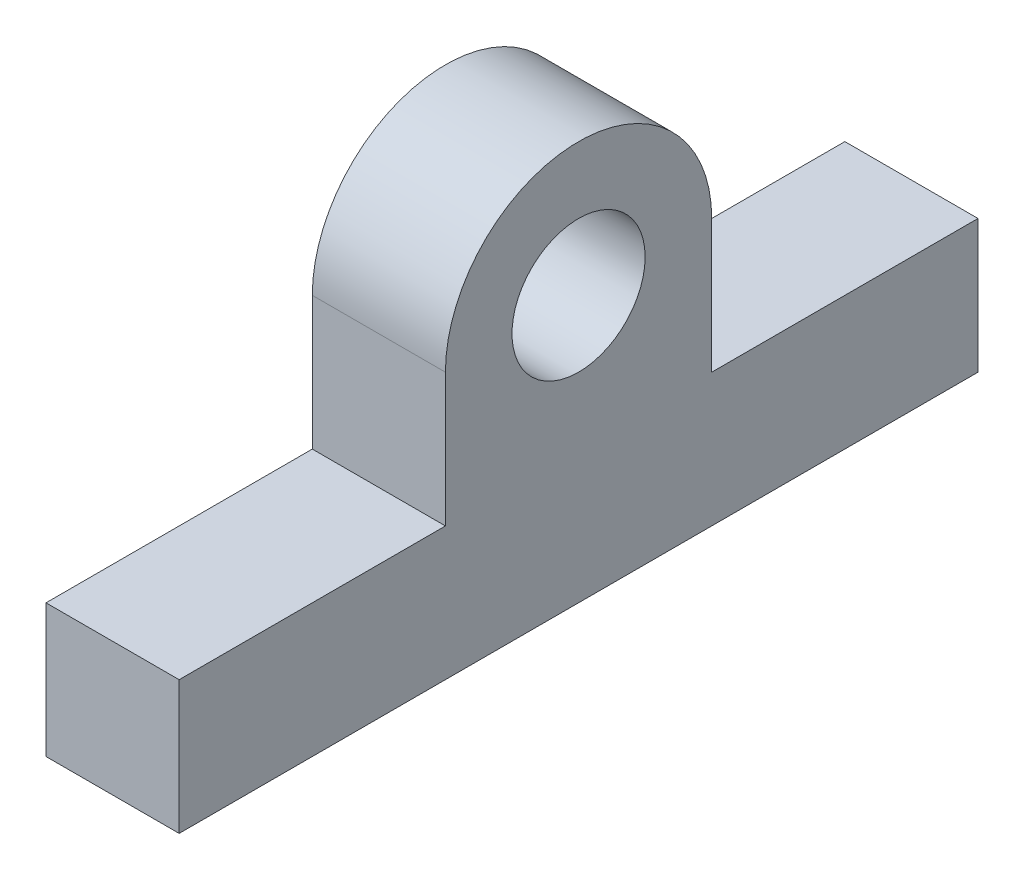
ISO-10303-21;
HEADER;
FILE_DESCRIPTION(('STEP AP214'),'2;1');
FILE_NAME('part.step','',(''),(''),'','','');
FILE_SCHEMA(('AUTOMOTIVE_DESIGN { 1 0 10303 214 1 1 1 1 }'));
ENDSEC;
DATA;
#1=APPLICATION_CONTEXT('core data for automotive mechanical design processes');
#2=APPLICATION_PROTOCOL_DEFINITION('international standard','automotive_design',2000,#1);
#3=PRODUCT_CONTEXT('',#1,'mechanical');
#4=PRODUCT('Part','Part','',(#3));
#5=PRODUCT_RELATED_PRODUCT_CATEGORY('part','',(#4));
#6=PRODUCT_DEFINITION_FORMATION('','',#4);
#7=PRODUCT_DEFINITION_CONTEXT('part definition',#1,'design');
#8=PRODUCT_DEFINITION('design','',#6,#7);
#9=PRODUCT_DEFINITION_SHAPE('','',#8);
#10=(LENGTH_UNIT() NAMED_UNIT(*) SI_UNIT(.MILLI.,.METRE.));
#11=(NAMED_UNIT(*) PLANE_ANGLE_UNIT() SI_UNIT($,.RADIAN.));
#12=(NAMED_UNIT(*) SI_UNIT($,.STERADIAN.) SOLID_ANGLE_UNIT());
#13=UNCERTAINTY_MEASURE_WITH_UNIT(LENGTH_MEASURE(1.E-05),#10,'distance_accuracy_value','');
#14=(GEOMETRIC_REPRESENTATION_CONTEXT(3) GLOBAL_UNCERTAINTY_ASSIGNED_CONTEXT((#13)) GLOBAL_UNIT_ASSIGNED_CONTEXT((#10,
#11,#12)) REPRESENTATION_CONTEXT('',''));
#15=CARTESIAN_POINT('',(0.,0.,0.));
#16=DIRECTION('',(0.,0.,1.));
#17=DIRECTION('',(1.,0.,0.));
#18=AXIS2_PLACEMENT_3D('',#15,#16,#17);
#19=CARTESIAN_POINT('',(12.7,12.7,0.));
#20=DIRECTION('',(0.,0.,-1.));
#21=DIRECTION('',(0.,1.,0.));
#22=AXIS2_PLACEMENT_3D('',#19,#20,#21);
#23=PLANE('',#22);
#24=DIRECTION('',(0.,-1.,0.));
#25=VECTOR('',#24,1.);
#26=CARTESIAN_POINT('',(0.,12.7,0.));
#27=LINE('',#26,#25);
#28=CARTESIAN_POINT('',(0.,12.7,0.));
#29=VERTEX_POINT('',#28);
#30=CARTESIAN_POINT('',(0.,0.,0.));
#31=VERTEX_POINT('',#30);
#32=EDGE_CURVE('E133',#29,#31,#27,.T.);
#33=ORIENTED_EDGE('',*,*,#32,.T.);
#34=DIRECTION('',(-1.,0.,0.));
#35=VECTOR('',#34,1.);
#36=CARTESIAN_POINT('',(12.7,0.,0.));
#37=LINE('',#36,#35);
#38=CARTESIAN_POINT('',(12.7,0.,0.));
#39=VERTEX_POINT('',#38);
#40=EDGE_CURVE('E11',#39,#31,#37,.T.);
#41=ORIENTED_EDGE('',*,*,#40,.F.);
#42=DIRECTION('',(0.,-1.,0.));
#43=VECTOR('',#42,1.);
#44=CARTESIAN_POINT('',(12.7,12.7,0.));
#45=LINE('',#44,#43);
#46=CARTESIAN_POINT('',(12.7,12.7,0.));
#47=VERTEX_POINT('',#46);
#48=EDGE_CURVE('E148',#47,#39,#45,.T.);
#49=ORIENTED_EDGE('',*,*,#48,.F.);
#50=DIRECTION('',(-1.,0.,0.));
#51=VECTOR('',#50,1.);
#52=CARTESIAN_POINT('',(12.7,12.7,0.));
#53=LINE('',#52,#51);
#54=EDGE_CURVE('E129',#47,#29,#53,.T.);
#55=ORIENTED_EDGE('',*,*,#54,.T.);
#56=EDGE_LOOP('',(#33,#41,#49,#55));
#57=FACE_BOUND('',#56,.T.);
#58=ADVANCED_FACE('F37',(#57),#23,.F.);
#59=CARTESIAN_POINT('',(12.7,0.,0.));
#60=DIRECTION('',(0.,1.,0.));
#61=DIRECTION('',(0.,0.,1.));
#62=AXIS2_PLACEMENT_3D('',#59,#60,#61);
#63=PLANE('',#62);
#64=CARTESIAN_POINT('',(6.35,0.,-12.7));
#65=DIRECTION('',(0.,-1.,0.));
#66=DIRECTION('',(0.,0.,-1.));
#67=AXIS2_PLACEMENT_3D('',#64,#65,#66);
#68=CIRCLE('',#67,1.27);
#69=CARTESIAN_POINT('',(6.35,0.,-13.97));
#70=VERTEX_POINT('',#69);
#71=EDGE_CURVE('E193',#70,#70,#68,.T.);
#72=ORIENTED_EDGE('',*,*,#71,.F.);
#73=EDGE_LOOP('',(#72));
#74=FACE_BOUND('',#73,.T.);
#75=CARTESIAN_POINT('',(6.35,0.,-63.5));
#76=DIRECTION('',(0.,-1.,0.));
#77=DIRECTION('',(0.,0.,-1.));
#78=AXIS2_PLACEMENT_3D('',#75,#76,#77);
#79=CIRCLE('',#78,1.27);
#80=CARTESIAN_POINT('',(6.35,0.,-64.77));
#81=VERTEX_POINT('',#80);
#82=EDGE_CURVE('E190',#81,#81,#79,.T.);
#83=ORIENTED_EDGE('',*,*,#82,.F.);
#84=EDGE_LOOP('',(#83));
#85=FACE_BOUND('',#84,.T.);
#86=DIRECTION('',(0.,0.,-1.));
#87=VECTOR('',#86,1.);
#88=CARTESIAN_POINT('',(0.,0.,0.));
#89=LINE('',#88,#87);
#90=CARTESIAN_POINT('',(0.,0.,-76.2));
#91=VERTEX_POINT('',#90);
#92=EDGE_CURVE('E136',#31,#91,#89,.T.);
#93=ORIENTED_EDGE('',*,*,#92,.T.);
#94=DIRECTION('',(-1.,0.,0.));
#95=VECTOR('',#94,1.);
#96=CARTESIAN_POINT('',(12.7,0.,-76.2));
#97=LINE('',#96,#95);
#98=CARTESIAN_POINT('',(12.7,0.,-76.2));
#99=VERTEX_POINT('',#98);
#100=EDGE_CURVE('E45',#99,#91,#97,.T.);
#101=ORIENTED_EDGE('',*,*,#100,.F.);
#102=DIRECTION('',(0.,0.,-1.));
#103=VECTOR('',#102,1.);
#104=CARTESIAN_POINT('',(12.7,0.,0.));
#105=LINE('',#104,#103);
#106=EDGE_CURVE('E96',#39,#99,#105,.T.);
#107=ORIENTED_EDGE('',*,*,#106,.F.);
#108=ORIENTED_EDGE('',*,*,#40,.T.);
#109=EDGE_LOOP('',(#93,#101,#107,#108));
#110=FACE_BOUND('',#109,.T.);
#111=ADVANCED_FACE('F208',(#74,#85,#110),#63,.F.);
#112=CARTESIAN_POINT('',(12.7,0.,-76.2));
#113=DIRECTION('',(0.,0.,1.));
#114=DIRECTION('',(1.,0.,0.));
#115=AXIS2_PLACEMENT_3D('',#112,#113,#114);
#116=PLANE('',#115);
#117=DIRECTION('',(0.,1.,0.));
#118=VECTOR('',#117,1.);
#119=CARTESIAN_POINT('',(0.,0.,-76.2));
#120=LINE('',#119,#118);
#121=CARTESIAN_POINT('',(0.,12.7,-76.2));
#122=VERTEX_POINT('',#121);
#123=EDGE_CURVE('E139',#91,#122,#120,.T.);
#124=ORIENTED_EDGE('',*,*,#123,.T.);
#125=DIRECTION('',(-1.,0.,0.));
#126=VECTOR('',#125,1.);
#127=CARTESIAN_POINT('',(12.7,12.7,-76.2));
#128=LINE('',#127,#126);
#129=CARTESIAN_POINT('',(12.7,12.7,-76.2));
#130=VERTEX_POINT('',#129);
#131=EDGE_CURVE('E155',#130,#122,#128,.T.);
#132=ORIENTED_EDGE('',*,*,#131,.F.);
#133=DIRECTION('',(0.,1.,0.));
#134=VECTOR('',#133,1.);
#135=CARTESIAN_POINT('',(12.7,0.,-76.2));
#136=LINE('',#135,#134);
#137=EDGE_CURVE('E163',#99,#130,#136,.T.);
#138=ORIENTED_EDGE('',*,*,#137,.F.);
#139=ORIENTED_EDGE('',*,*,#100,.T.);
#140=EDGE_LOOP('',(#124,#132,#138,#139));
#141=FACE_BOUND('',#140,.T.);
#142=ADVANCED_FACE('F161',(#141),#116,.F.);
#143=CARTESIAN_POINT('',(12.7,12.7,-76.2));
#144=DIRECTION('',(0.,-1.,0.));
#145=DIRECTION('',(0.,0.,-1.));
#146=AXIS2_PLACEMENT_3D('',#143,#144,#145);
#147=PLANE('',#146);
#148=DIRECTION('',(0.,0.,1.));
#149=VECTOR('',#148,1.);
#150=CARTESIAN_POINT('',(0.,12.7,-76.2));
#151=LINE('',#150,#149);
#152=CARTESIAN_POINT('',(0.,12.7,-50.8));
#153=VERTEX_POINT('',#152);
#154=EDGE_CURVE('E141',#122,#153,#151,.T.);
#155=ORIENTED_EDGE('',*,*,#154,.T.);
#156=DIRECTION('',(-1.,0.,0.));
#157=VECTOR('',#156,1.);
#158=CARTESIAN_POINT('',(12.7,12.7,-50.8));
#159=LINE('',#158,#157);
#160=CARTESIAN_POINT('',(12.7,12.7,-50.8));
#161=VERTEX_POINT('',#160);
#162=EDGE_CURVE('E152',#161,#153,#159,.T.);
#163=ORIENTED_EDGE('',*,*,#162,.F.);
#164=DIRECTION('',(0.,0.,1.));
#165=VECTOR('',#164,1.);
#166=CARTESIAN_POINT('',(12.7,12.7,-76.2));
#167=LINE('',#166,#165);
#168=EDGE_CURVE('E175',#130,#161,#167,.T.);
#169=ORIENTED_EDGE('',*,*,#168,.F.);
#170=ORIENTED_EDGE('',*,*,#131,.T.);
#171=EDGE_LOOP('',(#155,#163,#169,#170));
#172=FACE_BOUND('',#171,.T.);
#173=ADVANCED_FACE('F171',(#172),#147,.F.);
#174=CARTESIAN_POINT('',(12.7,12.7,-50.8));
#175=DIRECTION('',(0.,0.,1.));
#176=DIRECTION('',(0.,-1.,0.));
#177=AXIS2_PLACEMENT_3D('',#174,#175,#176);
#178=PLANE('',#177);
#179=DIRECTION('',(0.,1.,0.));
#180=VECTOR('',#179,1.);
#181=CARTESIAN_POINT('',(0.,12.7,-50.8));
#182=LINE('',#181,#180);
#183=CARTESIAN_POINT('',(0.,25.4,-50.8));
#184=VERTEX_POINT('',#183);
#185=EDGE_CURVE('E143',#153,#184,#182,.T.);
#186=ORIENTED_EDGE('',*,*,#185,.T.);
#187=DIRECTION('',(-1.,0.,0.));
#188=VECTOR('',#187,1.);
#189=CARTESIAN_POINT('',(12.7,25.4,-50.8));
#190=LINE('',#189,#188);
#191=CARTESIAN_POINT('',(12.7,25.4,-50.8));
#192=VERTEX_POINT('',#191);
#193=EDGE_CURVE('E124',#192,#184,#190,.T.);
#194=ORIENTED_EDGE('',*,*,#193,.F.);
#195=DIRECTION('',(0.,1.,0.));
#196=VECTOR('',#195,1.);
#197=CARTESIAN_POINT('',(12.7,12.7,-50.8));
#198=LINE('',#197,#196);
#199=EDGE_CURVE('E115',#161,#192,#198,.T.);
#200=ORIENTED_EDGE('',*,*,#199,.F.);
#201=ORIENTED_EDGE('',*,*,#162,.T.);
#202=EDGE_LOOP('',(#186,#194,#200,#201));
#203=FACE_BOUND('',#202,.T.);
#204=ADVANCED_FACE('F174',(#203),#178,.F.);
#205=CARTESIAN_POINT('',(12.7,25.4,-38.1));
#206=DIRECTION('',(-1.,0.,0.));
#207=DIRECTION('',(0.,0.,1.));
#208=AXIS2_PLACEMENT_3D('',#205,#206,#207);
#209=CYLINDRICAL_SURFACE('',#208,12.7);
#210=CARTESIAN_POINT('',(0.,25.4,-38.1));
#211=DIRECTION('',(1.,0.,0.));
#212=DIRECTION('',(0.,0.,-1.));
#213=AXIS2_PLACEMENT_3D('',#210,#211,#212);
#214=CIRCLE('',#213,12.7);
#215=CARTESIAN_POINT('',(0.,25.4,-25.4));
#216=VERTEX_POINT('',#215);
#217=EDGE_CURVE('E123',#184,#216,#214,.T.);
#218=ORIENTED_EDGE('',*,*,#217,.T.);
#219=DIRECTION('',(-1.,0.,0.));
#220=VECTOR('',#219,1.);
#221=CARTESIAN_POINT('',(12.7,25.4,-25.4));
#222=LINE('',#221,#220);
#223=CARTESIAN_POINT('',(12.7,25.4,-25.4));
#224=VERTEX_POINT('',#223);
#225=EDGE_CURVE('E120',#224,#216,#222,.T.);
#226=ORIENTED_EDGE('',*,*,#225,.F.);
#227=CARTESIAN_POINT('',(12.7,25.4,-38.1));
#228=DIRECTION('',(1.,0.,0.));
#229=DIRECTION('',(0.,0.,-1.));
#230=AXIS2_PLACEMENT_3D('',#227,#228,#229);
#231=CIRCLE('',#230,12.7);
#232=EDGE_CURVE('E109',#192,#224,#231,.T.);
#233=ORIENTED_EDGE('',*,*,#232,.F.);
#234=ORIENTED_EDGE('',*,*,#193,.T.);
#235=EDGE_LOOP('',(#218,#226,#233,#234));
#236=FACE_BOUND('',#235,.T.);
#237=ADVANCED_FACE('F121',(#236),#209,.T.);
#238=CARTESIAN_POINT('',(12.7,25.4,-25.4));
#239=DIRECTION('',(0.,0.,-1.));
#240=DIRECTION('',(0.,1.,0.));
#241=AXIS2_PLACEMENT_3D('',#238,#239,#240);
#242=PLANE('',#241);
#243=DIRECTION('',(0.,-1.,0.));
#244=VECTOR('',#243,1.);
#245=CARTESIAN_POINT('',(0.,25.4,-25.4));
#246=LINE('',#245,#244);
#247=CARTESIAN_POINT('',(0.,12.7,-25.4));
#248=VERTEX_POINT('',#247);
#249=EDGE_CURVE('E82',#216,#248,#246,.T.);
#250=ORIENTED_EDGE('',*,*,#249,.T.);
#251=DIRECTION('',(-1.,0.,0.));
#252=VECTOR('',#251,1.);
#253=CARTESIAN_POINT('',(12.7,12.7,-25.4));
#254=LINE('',#253,#252);
#255=CARTESIAN_POINT('',(12.7,12.7,-25.4));
#256=VERTEX_POINT('',#255);
#257=EDGE_CURVE('E125',#256,#248,#254,.T.);
#258=ORIENTED_EDGE('',*,*,#257,.F.);
#259=DIRECTION('',(0.,-1.,0.));
#260=VECTOR('',#259,1.);
#261=CARTESIAN_POINT('',(12.7,25.4,-25.4));
#262=LINE('',#261,#260);
#263=EDGE_CURVE('E113',#224,#256,#262,.T.);
#264=ORIENTED_EDGE('',*,*,#263,.F.);
#265=ORIENTED_EDGE('',*,*,#225,.T.);
#266=EDGE_LOOP('',(#250,#258,#264,#265));
#267=FACE_BOUND('',#266,.T.);
#268=ADVANCED_FACE('F127',(#267),#242,.F.);
#269=CARTESIAN_POINT('',(12.7,12.7,-25.4));
#270=DIRECTION('',(0.,-1.,0.));
#271=DIRECTION('',(0.,0.,-1.));
#272=AXIS2_PLACEMENT_3D('',#269,#270,#271);
#273=PLANE('',#272);
#274=DIRECTION('',(0.,0.,1.));
#275=VECTOR('',#274,1.);
#276=CARTESIAN_POINT('',(0.,12.7,-25.4));
#277=LINE('',#276,#275);
#278=EDGE_CURVE('E88',#248,#29,#277,.T.);
#279=ORIENTED_EDGE('',*,*,#278,.T.);
#280=ORIENTED_EDGE('',*,*,#54,.F.);
#281=DIRECTION('',(0.,0.,1.));
#282=VECTOR('',#281,1.);
#283=CARTESIAN_POINT('',(12.7,12.7,-25.4));
#284=LINE('',#283,#282);
#285=EDGE_CURVE('E53',#256,#47,#284,.T.);
#286=ORIENTED_EDGE('',*,*,#285,.F.);
#287=ORIENTED_EDGE('',*,*,#257,.T.);
#288=EDGE_LOOP('',(#279,#280,#286,#287));
#289=FACE_BOUND('',#288,.T.);
#290=ADVANCED_FACE('F215',(#289),#273,.F.);
#291=CARTESIAN_POINT('',(12.7,25.4,-38.1));
#292=DIRECTION('',(1.,0.,0.));
#293=DIRECTION('',(0.,0.,-1.));
#294=AXIS2_PLACEMENT_3D('',#291,#292,#293);
#295=PLANE('',#294);
#296=CARTESIAN_POINT('',(12.7,25.4,-38.1));
#297=DIRECTION('',(1.,0.,0.));
#298=DIRECTION('',(0.,0.,-1.));
#299=AXIS2_PLACEMENT_3D('',#296,#297,#298);
#300=CIRCLE('',#299,6.35);
#301=CARTESIAN_POINT('',(12.7,25.4,-44.45));
#302=VERTEX_POINT('',#301);
#303=EDGE_CURVE('E181',#302,#302,#300,.T.);
#304=ORIENTED_EDGE('',*,*,#303,.F.);
#305=EDGE_LOOP('',(#304));
#306=FACE_BOUND('',#305,.T.);
#307=ORIENTED_EDGE('',*,*,#48,.T.);
#308=ORIENTED_EDGE('',*,*,#106,.T.);
#309=ORIENTED_EDGE('',*,*,#137,.T.);
#310=ORIENTED_EDGE('',*,*,#168,.T.);
#311=ORIENTED_EDGE('',*,*,#199,.T.);
#312=ORIENTED_EDGE('',*,*,#232,.T.);
#313=ORIENTED_EDGE('',*,*,#263,.T.);
#314=ORIENTED_EDGE('',*,*,#285,.T.);
#315=EDGE_LOOP('',(#307,#308,#309,#310,#311,#312,#313,#314));
#316=FACE_BOUND('',#315,.T.);
#317=ADVANCED_FACE('F111',(#306,#316),#295,.T.);
#318=CARTESIAN_POINT('',(0.,25.4,-38.1));
#319=DIRECTION('',(1.,0.,0.));
#320=DIRECTION('',(0.,0.,-1.));
#321=AXIS2_PLACEMENT_3D('',#318,#319,#320);
#322=PLANE('',#321);
#323=CARTESIAN_POINT('',(0.,25.4,-38.1));
#324=DIRECTION('',(1.,0.,0.));
#325=DIRECTION('',(0.,0.,-1.));
#326=AXIS2_PLACEMENT_3D('',#323,#324,#325);
#327=CIRCLE('',#326,6.35);
#328=CARTESIAN_POINT('',(0.,25.4,-44.45));
#329=VERTEX_POINT('',#328);
#330=EDGE_CURVE('E137',#329,#329,#327,.T.);
#331=ORIENTED_EDGE('',*,*,#330,.T.);
#332=EDGE_LOOP('',(#331));
#333=FACE_BOUND('',#332,.T.);
#334=ORIENTED_EDGE('',*,*,#32,.F.);
#335=ORIENTED_EDGE('',*,*,#278,.F.);
#336=ORIENTED_EDGE('',*,*,#249,.F.);
#337=ORIENTED_EDGE('',*,*,#217,.F.);
#338=ORIENTED_EDGE('',*,*,#185,.F.);
#339=ORIENTED_EDGE('',*,*,#154,.F.);
#340=ORIENTED_EDGE('',*,*,#123,.F.);
#341=ORIENTED_EDGE('',*,*,#92,.F.);
#342=EDGE_LOOP('',(#334,#335,#336,#337,#338,#339,#340,#341));
#343=FACE_BOUND('',#342,.T.);
#344=ADVANCED_FACE('F167',(#333,#343),#322,.F.);
#345=CARTESIAN_POINT('',(0.,25.4,-38.1));
#346=DIRECTION('',(1.,0.,0.));
#347=DIRECTION('',(0.,0.,-1.));
#348=AXIS2_PLACEMENT_3D('',#345,#346,#347);
#349=CYLINDRICAL_SURFACE('',#348,6.35);
#350=ORIENTED_EDGE('',*,*,#330,.F.);
#351=EDGE_LOOP('',(#350));
#352=FACE_BOUND('',#351,.T.);
#353=ORIENTED_EDGE('',*,*,#303,.T.);
#354=EDGE_LOOP('',(#353));
#355=FACE_BOUND('',#354,.T.);
#356=ADVANCED_FACE('F284',(#352,#355),#349,.F.);
#357=CARTESIAN_POINT('',(6.35,6.35,-63.5));
#358=DIRECTION('',(0.,-1.,0.));
#359=DIRECTION('',(0.,0.,-1.));
#360=AXIS2_PLACEMENT_3D('',#357,#358,#359);
#361=CYLINDRICAL_SURFACE('',#360,1.27);
#362=CARTESIAN_POINT('',(6.35,6.35,-63.5));
#363=DIRECTION('',(0.,-1.,0.));
#364=DIRECTION('',(0.,0.,-1.));
#365=AXIS2_PLACEMENT_3D('',#362,#363,#364);
#366=CIRCLE('',#365,1.27);
#367=CARTESIAN_POINT('',(6.35,6.35,-64.77));
#368=VERTEX_POINT('',#367);
#369=EDGE_CURVE('E187',#368,#368,#366,.T.);
#370=ORIENTED_EDGE('',*,*,#369,.F.);
#371=EDGE_LOOP('',(#370));
#372=FACE_BOUND('',#371,.T.);
#373=ORIENTED_EDGE('',*,*,#82,.T.);
#374=EDGE_LOOP('',(#373));
#375=FACE_BOUND('',#374,.T.);
#376=ADVANCED_FACE('F293',(#372,#375),#361,.F.);
#377=CARTESIAN_POINT('',(6.35,6.35,-63.5));
#378=DIRECTION('',(0.,-1.,0.));
#379=DIRECTION('',(0.,0.,-1.));
#380=AXIS2_PLACEMENT_3D('',#377,#378,#379);
#381=PLANE('',#380);
#382=ORIENTED_EDGE('',*,*,#369,.T.);
#383=EDGE_LOOP('',(#382));
#384=FACE_BOUND('',#383,.T.);
#385=ADVANCED_FACE('F204',(#384),#381,.T.);
#386=CARTESIAN_POINT('',(6.35,6.35,-12.7));
#387=DIRECTION('',(0.,-1.,0.));
#388=DIRECTION('',(0.,0.,-1.));
#389=AXIS2_PLACEMENT_3D('',#386,#387,#388);
#390=CYLINDRICAL_SURFACE('',#389,1.27);
#391=CARTESIAN_POINT('',(6.35,6.35,-12.7));
#392=DIRECTION('',(0.,-1.,0.));
#393=DIRECTION('',(0.,0.,-1.));
#394=AXIS2_PLACEMENT_3D('',#391,#392,#393);
#395=CIRCLE('',#394,1.27);
#396=CARTESIAN_POINT('',(6.35,6.35,-13.97));
#397=VERTEX_POINT('',#396);
#398=EDGE_CURVE('E184',#397,#397,#395,.T.);
#399=ORIENTED_EDGE('',*,*,#398,.F.);
#400=EDGE_LOOP('',(#399));
#401=FACE_BOUND('',#400,.T.);
#402=ORIENTED_EDGE('',*,*,#71,.T.);
#403=EDGE_LOOP('',(#402));
#404=FACE_BOUND('',#403,.T.);
#405=ADVANCED_FACE('F201',(#401,#404),#390,.F.);
#406=CARTESIAN_POINT('',(6.35,6.35,-12.7));
#407=DIRECTION('',(0.,-1.,0.));
#408=DIRECTION('',(0.,0.,-1.));
#409=AXIS2_PLACEMENT_3D('',#406,#407,#408);
#410=PLANE('',#409);
#411=ORIENTED_EDGE('',*,*,#398,.T.);
#412=EDGE_LOOP('',(#411));
#413=FACE_BOUND('',#412,.T.);
#414=ADVANCED_FACE('F199',(#413),#410,.T.);
#415=CLOSED_SHELL('',(#58,#111,#142,#173,#204,#237,#268,#290,#317,#344,#356,#376,#385,#405,#414));
#416=MANIFOLD_SOLID_BREP('B2',#415);
#417=ADVANCED_BREP_SHAPE_REPRESENTATION('',(#18,#416),#14);
#418=SHAPE_DEFINITION_REPRESENTATION(#9,#417);
ENDSEC;
END-ISO-10303-21;
